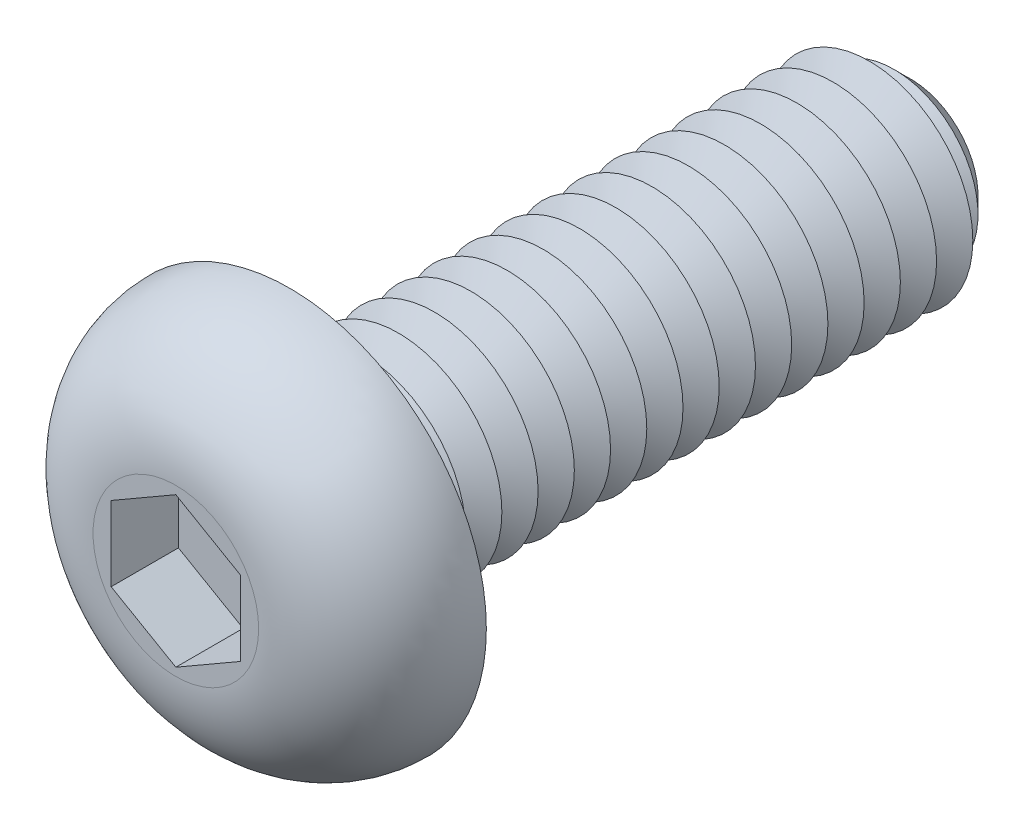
from build123d import *

# Parameters (mm, degrees)
CUT_EXTRUDE1_DEPTH  = 1.3
SKETCH4_R           = 2
BOSS_EXTRUDE1_DEPTH = 12
CHAMFER1_SIZE       = 0.7
LPATTERN1_COUNT     = 16
LPATTERN1_PITCH     = 0.7
FILLET2_R           = 0.35
SKETCH6_R           = 0.5
CUT_EXTRUDE2_DEPTH  = 12.9


with BuildPart() as part:
    # Sketch2 → Revolve1 (revolve)
    with BuildSketch(Plane(origin=(0, 0, 0), x_dir=(0, 0, -1), z_dir=(1, 0, 0)), mode=Mode.PRIVATE) as revolve1_sk:
        with BuildLine():
            Line((0, 0), (-2.2, 0))
            Line((-2.2, 0), (-2.2, 1.6))
            ThreePointArc((-2.2, 1.6), (-1.555634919, 3.155634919), (0, 3.8))
            Line((0, 3.8), (0, 0))
        make_face()
    revolve(revolve1_sk.sketch.rotate(Axis((0, 0, 47.934239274), (0, 0, -1)), 90), axis=Axis((0, 0, 47.934239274), (0, 0, -1)))

    # Sketch3 → Cut-Extrude1 (cut)
    with BuildSketch(Plane.XY.offset(2.2)):
        Polygon((0, 1.443375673), (-1.25, 0.721687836), (-1.25, -0.721687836), (0, -1.443375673), (1.25, -0.721687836), (1.25, 0.721687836), align=None)
    extrude(amount=-CUT_EXTRUDE1_DEPTH, mode=Mode.SUBTRACT)

    # Sketch4 → Boss-Extrude1 (add)
    with BuildSketch(Plane(origin=(0, 0, 0), x_dir=(-1, 0, 0), z_dir=(0, 0, -1))):
        with Locations(Location((0, 0, 0), (0, 0, 180))):
            Circle(SKETCH4_R)
    extrude(amount=BOSS_EXTRUDE1_DEPTH)

    # Chamfer1
    chamfer1_edges = [part.edges().sort_by_distance(p)[0] for p in [
        (-2, 0, -12),
    ]]
    chamfer(chamfer1_edges, length=CHAMFER1_SIZE)

    # Sketch5 → Cut-Revolve1 (revolve, cut)
    with BuildSketch(Plane(origin=(0, 0, 0), x_dir=(0, 0, -1), z_dir=(1, 0, 0)), mode=Mode.PRIVATE) as cut_revolve1_sk:
        Polygon((0.7, 2), (1.4, 2), (1.05, 1.393782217), align=None)
    cut_revolve1 = revolve(cut_revolve1_sk.sketch.rotate(Axis((0, 0, 47.934239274), (0, 0, -1)), 90), axis=Axis((0, 0, 47.934239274), (0, 0, -1)), mode=Mode.SUBTRACT)

    # LPattern1: Cut-Revolve1 ×16
    with Locations(*[(0, 0, -i * LPATTERN1_PITCH) for i in range(1, LPATTERN1_COUNT)]):
        add(cut_revolve1, mode=Mode.SUBTRACT)

    # Fillet2
    fillet2_edges = [part.edges().sort_by_distance(p)[0] for p in [
        (-2, 0, 0),
    ]]
    fillet(fillet2_edges, radius=FILLET2_R)

    # Sketch6 → Cut-Extrude2 (cut)
    with BuildSketch(Plane.XY.offset(0.9)):
        Circle(SKETCH6_R)
    extrude(amount=-CUT_EXTRUDE2_DEPTH, mode=Mode.SUBTRACT)


solid = part.part
